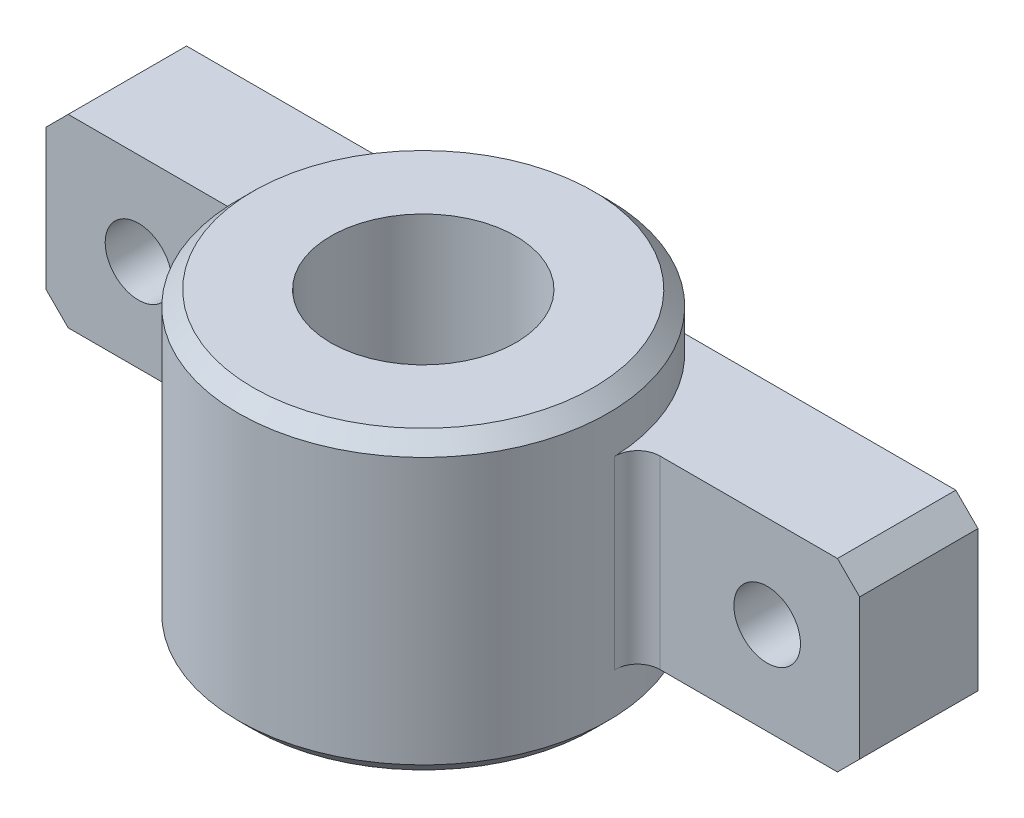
ISO-10303-21;
HEADER;
FILE_DESCRIPTION(('STEP AP214'),'2;1');
FILE_NAME('part.step','',(''),(''),'','','');
FILE_SCHEMA(('AUTOMOTIVE_DESIGN { 1 0 10303 214 1 1 1 1 }'));
ENDSEC;
DATA;
#1=APPLICATION_CONTEXT('core data for automotive mechanical design processes');
#2=APPLICATION_PROTOCOL_DEFINITION('international standard','automotive_design',2000,#1);
#3=PRODUCT_CONTEXT('',#1,'mechanical');
#4=PRODUCT('Part','Part','',(#3));
#5=PRODUCT_RELATED_PRODUCT_CATEGORY('part','',(#4));
#6=PRODUCT_DEFINITION_FORMATION('','',#4);
#7=PRODUCT_DEFINITION_CONTEXT('part definition',#1,'design');
#8=PRODUCT_DEFINITION('design','',#6,#7);
#9=PRODUCT_DEFINITION_SHAPE('','',#8);
#10=(LENGTH_UNIT() NAMED_UNIT(*) SI_UNIT(.MILLI.,.METRE.));
#11=(NAMED_UNIT(*) PLANE_ANGLE_UNIT() SI_UNIT($,.RADIAN.));
#12=(NAMED_UNIT(*) SI_UNIT($,.STERADIAN.) SOLID_ANGLE_UNIT());
#13=UNCERTAINTY_MEASURE_WITH_UNIT(LENGTH_MEASURE(1.E-05),#10,'distance_accuracy_value','');
#14=(GEOMETRIC_REPRESENTATION_CONTEXT(3) GLOBAL_UNCERTAINTY_ASSIGNED_CONTEXT((#13)) GLOBAL_UNIT_ASSIGNED_CONTEXT((#10,
#11,#12)) REPRESENTATION_CONTEXT('',''));
#15=CARTESIAN_POINT('',(0.,0.,0.));
#16=DIRECTION('',(0.,0.,1.));
#17=DIRECTION('',(1.,0.,0.));
#18=AXIS2_PLACEMENT_3D('',#15,#16,#17);
#19=CARTESIAN_POINT('',(0.,20.,0.));
#20=DIRECTION('',(0.,1.,0.));
#21=DIRECTION('',(0.,0.,1.));
#22=AXIS2_PLACEMENT_3D('',#19,#20,#21);
#23=PLANE('',#22);
#24=CARTESIAN_POINT('',(0.,20.,0.));
#25=DIRECTION('',(0.,1.,0.));
#26=DIRECTION('',(0.,0.,1.));
#27=AXIS2_PLACEMENT_3D('',#24,#25,#26);
#28=CIRCLE('',#27,23.);
#29=CARTESIAN_POINT('',(0.,20.,23.));
#30=VERTEX_POINT('',#29);
#31=EDGE_CURVE('E295',#30,#30,#28,.T.);
#32=ORIENTED_EDGE('',*,*,#31,.T.);
#33=EDGE_LOOP('',(#32));
#34=FACE_BOUND('',#33,.T.);
#35=CARTESIAN_POINT('',(0.,20.,0.));
#36=DIRECTION('',(0.,1.,0.));
#37=DIRECTION('',(0.,0.,1.));
#38=AXIS2_PLACEMENT_3D('',#35,#36,#37);
#39=CIRCLE('',#38,12.5);
#40=CARTESIAN_POINT('',(0.,20.,12.5));
#41=VERTEX_POINT('',#40);
#42=EDGE_CURVE('E229',#41,#41,#39,.T.);
#43=ORIENTED_EDGE('',*,*,#42,.F.);
#44=EDGE_LOOP('',(#43));
#45=FACE_BOUND('',#44,.T.);
#46=ADVANCED_FACE('F41',(#34,#45),#23,.T.);
#47=CARTESIAN_POINT('',(0.,-20.,0.));
#48=DIRECTION('',(0.,1.,0.));
#49=DIRECTION('',(0.,0.,1.));
#50=AXIS2_PLACEMENT_3D('',#47,#48,#49);
#51=PLANE('',#50);
#52=CARTESIAN_POINT('',(0.,-20.,0.));
#53=DIRECTION('',(0.,1.,0.));
#54=DIRECTION('',(0.,0.,1.));
#55=AXIS2_PLACEMENT_3D('',#52,#53,#54);
#56=CIRCLE('',#55,13.5);
#57=CARTESIAN_POINT('',(0.,-20.,13.5));
#58=VERTEX_POINT('',#57);
#59=EDGE_CURVE('E50',#58,#58,#56,.T.);
#60=ORIENTED_EDGE('',*,*,#59,.T.);
#61=EDGE_LOOP('',(#60));
#62=FACE_BOUND('',#61,.T.);
#63=CARTESIAN_POINT('',(0.,-20.,0.));
#64=DIRECTION('',(0.,1.,0.));
#65=DIRECTION('',(0.,0.,1.));
#66=AXIS2_PLACEMENT_3D('',#63,#64,#65);
#67=CIRCLE('',#66,23.);
#68=CARTESIAN_POINT('',(0.,-20.,23.));
#69=VERTEX_POINT('',#68);
#70=EDGE_CURVE('E308',#69,#69,#67,.F.);
#71=ORIENTED_EDGE('',*,*,#70,.T.);
#72=EDGE_LOOP('',(#71));
#73=FACE_BOUND('',#72,.T.);
#74=ADVANCED_FACE('F315',(#62,#73),#51,.F.);
#75=CARTESIAN_POINT('',(0.,20.,0.));
#76=DIRECTION('',(0.,-1.,0.));
#77=DIRECTION('',(0.,0.,-1.));
#78=AXIS2_PLACEMENT_3D('',#75,#76,#77);
#79=CYLINDRICAL_SURFACE('',#78,25.);
#80=CARTESIAN_POINT('',(0.,18.,0.));
#81=DIRECTION('',(0.,1.,0.));
#82=DIRECTION('',(0.,0.,1.));
#83=AXIS2_PLACEMENT_3D('',#80,#81,#82);
#84=CIRCLE('',#83,25.);
#85=CARTESIAN_POINT('',(0.,18.,25.));
#86=VERTEX_POINT('',#85);
#87=EDGE_CURVE('E304',#86,#86,#84,.F.);
#88=ORIENTED_EDGE('',*,*,#87,.T.);
#89=EDGE_LOOP('',(#88));
#90=FACE_BOUND('',#89,.T.);
#91=CARTESIAN_POINT('',(0.,-18.,0.));
#92=DIRECTION('',(0.,1.,0.));
#93=DIRECTION('',(0.,0.,1.));
#94=AXIS2_PLACEMENT_3D('',#91,#92,#93);
#95=CIRCLE('',#94,25.);
#96=CARTESIAN_POINT('',(0.,-18.,25.));
#97=VERTEX_POINT('',#96);
#98=EDGE_CURVE('E300',#97,#97,#95,.T.);
#99=ORIENTED_EDGE('',*,*,#98,.T.);
#100=EDGE_LOOP('',(#99));
#101=FACE_BOUND('',#100,.T.);
#102=DIRECTION('',(0.,-1.,0.));
#103=VECTOR('',#102,1.);
#104=CARTESIAN_POINT('',(24.9840510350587,20.,-0.892857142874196));
#105=LINE('',#104,#103);
#106=CARTESIAN_POINT('',(24.9840510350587,-12.5,-0.892857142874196));
#107=VERTEX_POINT('',#106);
#108=CARTESIAN_POINT('',(24.9840510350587,12.5,-0.892857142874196));
#109=VERTEX_POINT('',#108);
#110=EDGE_CURVE('E288',#107,#109,#105,.F.);
#111=ORIENTED_EDGE('',*,*,#110,.T.);
#112=CARTESIAN_POINT('',(0.,12.5,0.));
#113=DIRECTION('',(0.,1.,0.));
#114=DIRECTION('',(0.,0.,1.));
#115=AXIS2_PLACEMENT_3D('',#112,#113,#114);
#116=CIRCLE('',#115,25.);
#117=CARTESIAN_POINT('',(15.,12.5,-20.));
#118=VERTEX_POINT('',#117);
#119=EDGE_CURVE('E155',#109,#118,#116,.T.);
#120=ORIENTED_EDGE('',*,*,#119,.T.);
#121=DIRECTION('',(0.,-1.,0.));
#122=VECTOR('',#121,1.);
#123=CARTESIAN_POINT('',(15.,12.5,-20.));
#124=LINE('',#123,#122);
#125=CARTESIAN_POINT('',(15.,-12.5,-20.));
#126=VERTEX_POINT('',#125);
#127=EDGE_CURVE('E148',#118,#126,#124,.T.);
#128=ORIENTED_EDGE('',*,*,#127,.T.);
#129=CARTESIAN_POINT('',(0.,-12.5,0.));
#130=DIRECTION('',(0.,1.,0.));
#131=DIRECTION('',(0.,0.,1.));
#132=AXIS2_PLACEMENT_3D('',#129,#130,#131);
#133=CIRCLE('',#132,25.);
#134=EDGE_CURVE('E153',#107,#126,#133,.T.);
#135=ORIENTED_EDGE('',*,*,#134,.F.);
#136=EDGE_LOOP('',(#111,#120,#128,#135));
#137=FACE_BOUND('',#136,.T.);
#138=CARTESIAN_POINT('',(0.,12.5,0.));
#139=DIRECTION('',(0.,1.,0.));
#140=DIRECTION('',(0.,0.,1.));
#141=AXIS2_PLACEMENT_3D('',#138,#139,#140);
#142=CIRCLE('',#141,25.);
#143=CARTESIAN_POINT('',(-15.,12.5,-20.));
#144=VERTEX_POINT('',#143);
#145=CARTESIAN_POINT('',(-24.9840510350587,12.5,-0.892857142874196));
#146=VERTEX_POINT('',#145);
#147=EDGE_CURVE('E235',#144,#146,#142,.T.);
#148=ORIENTED_EDGE('',*,*,#147,.T.);
#149=DIRECTION('',(0.,-1.,0.));
#150=VECTOR('',#149,1.);
#151=CARTESIAN_POINT('',(-24.9840510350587,20.,-0.892857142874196));
#152=LINE('',#151,#150);
#153=CARTESIAN_POINT('',(-24.9840510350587,-12.5,-0.892857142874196));
#154=VERTEX_POINT('',#153);
#155=EDGE_CURVE('E259',#146,#154,#152,.T.);
#156=ORIENTED_EDGE('',*,*,#155,.T.);
#157=CARTESIAN_POINT('',(0.,-12.5,0.));
#158=DIRECTION('',(0.,1.,0.));
#159=DIRECTION('',(0.,0.,1.));
#160=AXIS2_PLACEMENT_3D('',#157,#158,#159);
#161=CIRCLE('',#160,25.);
#162=CARTESIAN_POINT('',(-15.,-12.5,-20.));
#163=VERTEX_POINT('',#162);
#164=EDGE_CURVE('E232',#163,#154,#161,.T.);
#165=ORIENTED_EDGE('',*,*,#164,.F.);
#166=DIRECTION('',(0.,-1.,0.));
#167=VECTOR('',#166,1.);
#168=CARTESIAN_POINT('',(-15.,12.5,-20.));
#169=LINE('',#168,#167);
#170=EDGE_CURVE('E223',#144,#163,#169,.T.);
#171=ORIENTED_EDGE('',*,*,#170,.F.);
#172=EDGE_LOOP('',(#148,#156,#165,#171));
#173=FACE_BOUND('',#172,.T.);
#174=ADVANCED_FACE('F151',(#90,#101,#137,#173),#79,.T.);
#175=CARTESIAN_POINT('',(0.,20.,0.));
#176=DIRECTION('',(0.,-1.,0.));
#177=DIRECTION('',(0.,0.,-1.));
#178=AXIS2_PLACEMENT_3D('',#175,#176,#177);
#179=CYLINDRICAL_SURFACE('',#178,12.5);
#180=CARTESIAN_POINT('',(0.,-19.,0.));
#181=DIRECTION('',(0.,1.,0.));
#182=DIRECTION('',(0.,0.,1.));
#183=AXIS2_PLACEMENT_3D('',#180,#181,#182);
#184=CIRCLE('',#183,12.5);
#185=CARTESIAN_POINT('',(0.,-19.,12.5));
#186=VERTEX_POINT('',#185);
#187=EDGE_CURVE('E11',#186,#186,#184,.F.);
#188=ORIENTED_EDGE('',*,*,#187,.T.);
#189=EDGE_LOOP('',(#188));
#190=FACE_BOUND('',#189,.T.);
#191=ORIENTED_EDGE('',*,*,#42,.T.);
#192=EDGE_LOOP('',(#191));
#193=FACE_BOUND('',#192,.T.);
#194=ADVANCED_FACE('F336',(#190,#193),#179,.F.);
#195=CARTESIAN_POINT('',(-55.,12.5,-4.0000000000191));
#196=DIRECTION('',(0.,0.,-1.));
#197=DIRECTION('',(-1.,0.,0.));
#198=AXIS2_PLACEMENT_3D('',#195,#196,#197);
#199=PLANE('',#198);
#200=CARTESIAN_POINT('',(-42.5,0.,-4.0000000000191));
#201=DIRECTION('',(0.,0.,-1.));
#202=DIRECTION('',(-1.,0.,0.));
#203=AXIS2_PLACEMENT_3D('',#200,#201,#202);
#204=CIRCLE('',#203,4.5);
#205=CARTESIAN_POINT('',(-47.,0.,-4.0000000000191));
#206=VERTEX_POINT('',#205);
#207=EDGE_CURVE('E205',#206,#206,#204,.T.);
#208=ORIENTED_EDGE('',*,*,#207,.T.);
#209=EDGE_LOOP('',(#208));
#210=FACE_BOUND('',#209,.T.);
#211=DIRECTION('',(1.,0.,0.));
#212=VECTOR('',#211,1.);
#213=CARTESIAN_POINT('',(-55.,-12.5,-4.0000000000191));
#214=LINE('',#213,#212);
#215=CARTESIAN_POINT('',(-52.,-12.5,-4.0000000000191));
#216=VERTEX_POINT('',#215);
#217=CARTESIAN_POINT('',(-27.9821371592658,-12.5,-4.0000000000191));
#218=VERTEX_POINT('',#217);
#219=EDGE_CURVE('E214',#216,#218,#214,.T.);
#220=ORIENTED_EDGE('',*,*,#219,.T.);
#221=DIRECTION('',(0.,1.,0.));
#222=VECTOR('',#221,1.);
#223=CARTESIAN_POINT('',(-27.9821371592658,12.5,-4.0000000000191));
#224=LINE('',#223,#222);
#225=CARTESIAN_POINT('',(-27.9821371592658,12.5,-4.0000000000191));
#226=VERTEX_POINT('',#225);
#227=EDGE_CURVE('E255',#218,#226,#224,.T.);
#228=ORIENTED_EDGE('',*,*,#227,.T.);
#229=DIRECTION('',(1.,0.,0.));
#230=VECTOR('',#229,1.);
#231=CARTESIAN_POINT('',(-55.,12.5,-4.0000000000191));
#232=LINE('',#231,#230);
#233=CARTESIAN_POINT('',(-52.,12.5,-4.0000000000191));
#234=VERTEX_POINT('',#233);
#235=EDGE_CURVE('E206',#234,#226,#232,.T.);
#236=ORIENTED_EDGE('',*,*,#235,.F.);
#237=DIRECTION('',(-0.707106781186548,-0.707106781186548,0.));
#238=VECTOR('',#237,1.);
#239=CARTESIAN_POINT('',(-52.,12.5,-4.0000000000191));
#240=LINE('',#239,#238);
#241=CARTESIAN_POINT('',(-55.,9.49999999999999,-4.0000000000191));
#242=VERTEX_POINT('',#241);
#243=EDGE_CURVE('E242',#234,#242,#240,.T.);
#244=ORIENTED_EDGE('',*,*,#243,.T.);
#245=DIRECTION('',(0.,-1.,0.));
#246=VECTOR('',#245,1.);
#247=CARTESIAN_POINT('',(-55.,12.5,-4.0000000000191));
#248=LINE('',#247,#246);
#249=CARTESIAN_POINT('',(-55.,-9.50000000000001,-4.0000000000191));
#250=VERTEX_POINT('',#249);
#251=EDGE_CURVE('E226',#242,#250,#248,.T.);
#252=ORIENTED_EDGE('',*,*,#251,.T.);
#253=DIRECTION('',(-0.707106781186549,0.707106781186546,0.));
#254=VECTOR('',#253,1.);
#255=CARTESIAN_POINT('',(-55.,-9.50000000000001,-4.0000000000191));
#256=LINE('',#255,#254);
#257=EDGE_CURVE('E244',#250,#216,#256,.F.);
#258=ORIENTED_EDGE('',*,*,#257,.T.);
#259=EDGE_LOOP('',(#220,#228,#236,#244,#252,#258));
#260=FACE_BOUND('',#259,.T.);
#261=ADVANCED_FACE('F442',(#210,#260),#199,.F.);
#262=CARTESIAN_POINT('',(-55.,12.5,-20.));
#263=DIRECTION('',(1.,0.,0.));
#264=DIRECTION('',(0.,0.,-1.));
#265=AXIS2_PLACEMENT_3D('',#262,#263,#264);
#266=PLANE('',#265);
#267=DIRECTION('',(0.,-1.,0.));
#268=VECTOR('',#267,1.);
#269=CARTESIAN_POINT('',(-55.,12.5,-20.));
#270=LINE('',#269,#268);
#271=CARTESIAN_POINT('',(-55.,9.49999999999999,-20.));
#272=VERTEX_POINT('',#271);
#273=CARTESIAN_POINT('',(-55.,-9.50000000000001,-20.));
#274=VERTEX_POINT('',#273);
#275=EDGE_CURVE('E213',#272,#274,#270,.T.);
#276=ORIENTED_EDGE('',*,*,#275,.T.);
#277=DIRECTION('',(0.,0.,1.));
#278=VECTOR('',#277,1.);
#279=CARTESIAN_POINT('',(-55.,-9.50000000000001,-20.));
#280=LINE('',#279,#278);
#281=EDGE_CURVE('E239',#274,#250,#280,.T.);
#282=ORIENTED_EDGE('',*,*,#281,.T.);
#283=ORIENTED_EDGE('',*,*,#251,.F.);
#284=DIRECTION('',(0.,0.,-1.));
#285=VECTOR('',#284,1.);
#286=CARTESIAN_POINT('',(-55.,9.49999999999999,-20.));
#287=LINE('',#286,#285);
#288=EDGE_CURVE('E237',#242,#272,#287,.T.);
#289=ORIENTED_EDGE('',*,*,#288,.T.);
#290=EDGE_LOOP('',(#276,#282,#283,#289));
#291=FACE_BOUND('',#290,.T.);
#292=ADVANCED_FACE('F440',(#291),#266,.F.);
#293=CARTESIAN_POINT('',(-55.,12.5,-20.));
#294=DIRECTION('',(0.,0.,1.));
#295=DIRECTION('',(1.,0.,0.));
#296=AXIS2_PLACEMENT_3D('',#293,#294,#295);
#297=PLANE('',#296);
#298=CARTESIAN_POINT('',(-42.5,0.,-20.));
#299=DIRECTION('',(0.,0.,-1.));
#300=DIRECTION('',(-1.,0.,0.));
#301=AXIS2_PLACEMENT_3D('',#298,#299,#300);
#302=CIRCLE('',#301,8.525);
#303=CARTESIAN_POINT('',(-51.025,0.,-20.));
#304=VERTEX_POINT('',#303);
#305=EDGE_CURVE('E193',#304,#304,#302,.T.);
#306=ORIENTED_EDGE('',*,*,#305,.F.);
#307=EDGE_LOOP('',(#306));
#308=FACE_BOUND('',#307,.T.);
#309=DIRECTION('',(-1.,0.,0.));
#310=VECTOR('',#309,1.);
#311=CARTESIAN_POINT('',(-55.,-12.5,-20.));
#312=LINE('',#311,#310);
#313=CARTESIAN_POINT('',(-52.,-12.5,-20.));
#314=VERTEX_POINT('',#313);
#315=EDGE_CURVE('E210',#163,#314,#312,.T.);
#316=ORIENTED_EDGE('',*,*,#315,.T.);
#317=DIRECTION('',(0.707106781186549,-0.707106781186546,0.));
#318=VECTOR('',#317,1.);
#319=CARTESIAN_POINT('',(-55.,-9.50000000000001,-20.));
#320=LINE('',#319,#318);
#321=EDGE_CURVE('E250',#314,#274,#320,.F.);
#322=ORIENTED_EDGE('',*,*,#321,.T.);
#323=ORIENTED_EDGE('',*,*,#275,.F.);
#324=DIRECTION('',(0.707106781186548,0.707106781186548,0.));
#325=VECTOR('',#324,1.);
#326=CARTESIAN_POINT('',(-52.,12.5,-20.));
#327=LINE('',#326,#325);
#328=CARTESIAN_POINT('',(-52.,12.5,-20.));
#329=VERTEX_POINT('',#328);
#330=EDGE_CURVE('E248',#272,#329,#327,.T.);
#331=ORIENTED_EDGE('',*,*,#330,.T.);
#332=DIRECTION('',(-1.,0.,0.));
#333=VECTOR('',#332,1.);
#334=CARTESIAN_POINT('',(-55.,12.5,-20.));
#335=LINE('',#334,#333);
#336=EDGE_CURVE('E209',#144,#329,#335,.T.);
#337=ORIENTED_EDGE('',*,*,#336,.F.);
#338=ORIENTED_EDGE('',*,*,#170,.T.);
#339=EDGE_LOOP('',(#316,#322,#323,#331,#337,#338));
#340=FACE_BOUND('',#339,.T.);
#341=ADVANCED_FACE('F433',(#308,#340),#297,.F.);
#342=CARTESIAN_POINT('',(0.,12.5,0.));
#343=DIRECTION('',(0.,1.,0.));
#344=DIRECTION('',(0.,0.,1.));
#345=AXIS2_PLACEMENT_3D('',#342,#343,#344);
#346=PLANE('',#345);
#347=ORIENTED_EDGE('',*,*,#336,.T.);
#348=DIRECTION('',(0.,0.,1.));
#349=VECTOR('',#348,1.);
#350=CARTESIAN_POINT('',(-52.,12.5,-4.0000000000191));
#351=LINE('',#350,#349);
#352=EDGE_CURVE('E252',#329,#234,#351,.T.);
#353=ORIENTED_EDGE('',*,*,#352,.T.);
#354=ORIENTED_EDGE('',*,*,#235,.T.);
#355=CARTESIAN_POINT('',(-27.9821371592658,12.5,-1.0000000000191));
#356=DIRECTION('',(0.,1.,0.));
#357=DIRECTION('',(0.,0.,1.));
#358=AXIS2_PLACEMENT_3D('',#355,#356,#357);
#359=CIRCLE('',#358,3.);
#360=EDGE_CURVE('E263',#226,#146,#359,.F.);
#361=ORIENTED_EDGE('',*,*,#360,.T.);
#362=ORIENTED_EDGE('',*,*,#147,.F.);
#363=EDGE_LOOP('',(#347,#353,#354,#361,#362));
#364=FACE_BOUND('',#363,.T.);
#365=ADVANCED_FACE('F430',(#364),#346,.T.);
#366=CARTESIAN_POINT('',(0.,-12.5,0.));
#367=DIRECTION('',(0.,1.,0.));
#368=DIRECTION('',(0.,0.,1.));
#369=AXIS2_PLACEMENT_3D('',#366,#367,#368);
#370=PLANE('',#369);
#371=ORIENTED_EDGE('',*,*,#219,.F.);
#372=DIRECTION('',(0.,0.,-1.));
#373=VECTOR('',#372,1.);
#374=CARTESIAN_POINT('',(-52.,-12.5,0.));
#375=LINE('',#374,#373);
#376=EDGE_CURVE('E246',#216,#314,#375,.T.);
#377=ORIENTED_EDGE('',*,*,#376,.T.);
#378=ORIENTED_EDGE('',*,*,#315,.F.);
#379=ORIENTED_EDGE('',*,*,#164,.T.);
#380=CARTESIAN_POINT('',(-27.9821371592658,-12.5,-1.0000000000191));
#381=DIRECTION('',(0.,1.,0.));
#382=DIRECTION('',(0.,0.,1.));
#383=AXIS2_PLACEMENT_3D('',#380,#381,#382);
#384=CIRCLE('',#383,3.);
#385=EDGE_CURVE('E172',#154,#218,#384,.T.);
#386=ORIENTED_EDGE('',*,*,#385,.T.);
#387=EDGE_LOOP('',(#371,#377,#378,#379,#386));
#388=FACE_BOUND('',#387,.T.);
#389=ADVANCED_FACE('F346',(#388),#370,.F.);
#390=CARTESIAN_POINT('',(-55.,-9.50000000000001,-20.));
#391=DIRECTION('',(0.707106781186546,0.707106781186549,0.));
#392=DIRECTION('',(0.,0.,1.));
#393=AXIS2_PLACEMENT_3D('',#390,#391,#392);
#394=PLANE('',#393);
#395=ORIENTED_EDGE('',*,*,#321,.F.);
#396=ORIENTED_EDGE('',*,*,#376,.F.);
#397=ORIENTED_EDGE('',*,*,#257,.F.);
#398=ORIENTED_EDGE('',*,*,#281,.F.);
#399=EDGE_LOOP('',(#395,#396,#397,#398));
#400=FACE_BOUND('',#399,.T.);
#401=ADVANCED_FACE('F342',(#400),#394,.F.);
#402=CARTESIAN_POINT('',(-52.,12.5,0.));
#403=DIRECTION('',(-0.707106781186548,0.707106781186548,0.));
#404=DIRECTION('',(0.,0.,-1.));
#405=AXIS2_PLACEMENT_3D('',#402,#403,#404);
#406=PLANE('',#405);
#407=ORIENTED_EDGE('',*,*,#330,.F.);
#408=ORIENTED_EDGE('',*,*,#288,.F.);
#409=ORIENTED_EDGE('',*,*,#243,.F.);
#410=ORIENTED_EDGE('',*,*,#352,.F.);
#411=EDGE_LOOP('',(#407,#408,#409,#410));
#412=FACE_BOUND('',#411,.T.);
#413=ADVANCED_FACE('F345',(#412),#406,.T.);
#414=CARTESIAN_POINT('',(-27.9821371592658,20.,-1.0000000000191));
#415=DIRECTION('',(0.,-1.,0.));
#416=DIRECTION('',(0.,0.,-1.));
#417=AXIS2_PLACEMENT_3D('',#414,#415,#416);
#418=CYLINDRICAL_SURFACE('',#417,3.);
#419=ORIENTED_EDGE('',*,*,#385,.F.);
#420=ORIENTED_EDGE('',*,*,#155,.F.);
#421=ORIENTED_EDGE('',*,*,#360,.F.);
#422=ORIENTED_EDGE('',*,*,#227,.F.);
#423=EDGE_LOOP('',(#419,#420,#421,#422));
#424=FACE_BOUND('',#423,.T.);
#425=ADVANCED_FACE('F350',(#424),#418,.F.);
#426=CARTESIAN_POINT('',(-42.5,0.,-20.));
#427=DIRECTION('',(0.,0.,-1.));
#428=DIRECTION('',(-1.,0.,0.));
#429=AXIS2_PLACEMENT_3D('',#426,#427,#428);
#430=CYLINDRICAL_SURFACE('',#429,4.5);
#431=CARTESIAN_POINT('',(-42.5,0.,-11.4));
#432=DIRECTION('',(0.,0.,-1.));
#433=DIRECTION('',(-1.,0.,0.));
#434=AXIS2_PLACEMENT_3D('',#431,#432,#433);
#435=CIRCLE('',#434,4.5);
#436=CARTESIAN_POINT('',(-47.,0.,-11.4));
#437=VERTEX_POINT('',#436);
#438=EDGE_CURVE('E202',#437,#437,#435,.T.);
#439=ORIENTED_EDGE('',*,*,#438,.T.);
#440=EDGE_LOOP('',(#439));
#441=FACE_BOUND('',#440,.T.);
#442=ORIENTED_EDGE('',*,*,#207,.F.);
#443=EDGE_LOOP('',(#442));
#444=FACE_BOUND('',#443,.T.);
#445=ADVANCED_FACE('F354',(#441,#444),#430,.F.);
#446=CARTESIAN_POINT('',(-35.,0.,-11.4));
#447=DIRECTION('',(0.,0.,1.));
#448=DIRECTION('',(1.,0.,0.));
#449=AXIS2_PLACEMENT_3D('',#446,#447,#448);
#450=PLANE('',#449);
#451=ORIENTED_EDGE('',*,*,#438,.F.);
#452=EDGE_LOOP('',(#451));
#453=FACE_BOUND('',#452,.T.);
#454=CARTESIAN_POINT('',(-42.5,0.,-11.4));
#455=DIRECTION('',(0.,0.,-1.));
#456=DIRECTION('',(-1.,0.,0.));
#457=AXIS2_PLACEMENT_3D('',#454,#455,#456);
#458=CIRCLE('',#457,7.49999999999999);
#459=CARTESIAN_POINT('',(-50.,0.,-11.4));
#460=VERTEX_POINT('',#459);
#461=EDGE_CURVE('E199',#460,#460,#458,.T.);
#462=ORIENTED_EDGE('',*,*,#461,.T.);
#463=EDGE_LOOP('',(#462));
#464=FACE_BOUND('',#463,.T.);
#465=ADVANCED_FACE('F422',(#453,#464),#450,.F.);
#466=CARTESIAN_POINT('',(-42.5,0.,-20.));
#467=DIRECTION('',(0.,0.,-1.));
#468=DIRECTION('',(-1.,0.,0.));
#469=AXIS2_PLACEMENT_3D('',#466,#467,#468);
#470=CYLINDRICAL_SURFACE('',#469,7.5);
#471=ORIENTED_EDGE('',*,*,#461,.F.);
#472=EDGE_LOOP('',(#471));
#473=FACE_BOUND('',#472,.T.);
#474=CARTESIAN_POINT('',(-42.5,0.,-18.975));
#475=DIRECTION('',(0.,0.,-1.));
#476=DIRECTION('',(-1.,0.,0.));
#477=AXIS2_PLACEMENT_3D('',#474,#475,#476);
#478=CIRCLE('',#477,7.5);
#479=CARTESIAN_POINT('',(-50.,0.,-18.975));
#480=VERTEX_POINT('',#479);
#481=EDGE_CURVE('E196',#480,#480,#478,.T.);
#482=ORIENTED_EDGE('',*,*,#481,.T.);
#483=EDGE_LOOP('',(#482));
#484=FACE_BOUND('',#483,.T.);
#485=ADVANCED_FACE('F418',(#473,#484),#470,.F.);
#486=CARTESIAN_POINT('',(-42.5,0.,-20.));
#487=DIRECTION('',(0.,0.,-1.));
#488=DIRECTION('',(-1.,0.,0.));
#489=AXIS2_PLACEMENT_3D('',#486,#487,#488);
#490=CONICAL_SURFACE('',#489,8.525,0.785398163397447);
#491=ORIENTED_EDGE('',*,*,#481,.F.);
#492=EDGE_LOOP('',(#491));
#493=FACE_BOUND('',#492,.T.);
#494=ORIENTED_EDGE('',*,*,#305,.T.);
#495=EDGE_LOOP('',(#494));
#496=FACE_BOUND('',#495,.T.);
#497=ADVANCED_FACE('F408',(#493,#496),#490,.F.);
#498=CARTESIAN_POINT('',(55.,12.5,-4.0000000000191));
#499=DIRECTION('',(0.,0.,1.));
#500=DIRECTION('',(1.,0.,0.));
#501=AXIS2_PLACEMENT_3D('',#498,#499,#500);
#502=PLANE('',#501);
#503=CARTESIAN_POINT('',(42.5,0.,-4.0000000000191));
#504=DIRECTION('',(0.,0.,1.));
#505=DIRECTION('',(1.,0.,0.));
#506=AXIS2_PLACEMENT_3D('',#503,#504,#505);
#507=CIRCLE('',#506,4.5);
#508=CARTESIAN_POINT('',(47.,0.,-4.0000000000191));
#509=VERTEX_POINT('',#508);
#510=EDGE_CURVE('E179',#509,#509,#507,.T.);
#511=ORIENTED_EDGE('',*,*,#510,.F.);
#512=EDGE_LOOP('',(#511));
#513=FACE_BOUND('',#512,.T.);
#514=DIRECTION('',(-1.,0.,0.));
#515=VECTOR('',#514,1.);
#516=CARTESIAN_POINT('',(55.,12.5,-4.0000000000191));
#517=LINE('',#516,#515);
#518=CARTESIAN_POINT('',(52.,12.5,-4.0000000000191));
#519=VERTEX_POINT('',#518);
#520=CARTESIAN_POINT('',(27.9821371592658,12.5,-4.0000000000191));
#521=VERTEX_POINT('',#520);
#522=EDGE_CURVE('E187',#519,#521,#517,.T.);
#523=ORIENTED_EDGE('',*,*,#522,.T.);
#524=DIRECTION('',(0.,-1.,0.));
#525=VECTOR('',#524,1.);
#526=CARTESIAN_POINT('',(27.9821371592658,12.5,-4.0000000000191));
#527=LINE('',#526,#525);
#528=CARTESIAN_POINT('',(27.9821371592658,-12.5,-4.0000000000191));
#529=VERTEX_POINT('',#528);
#530=EDGE_CURVE('E66',#521,#529,#527,.T.);
#531=ORIENTED_EDGE('',*,*,#530,.T.);
#532=DIRECTION('',(-1.,0.,0.));
#533=VECTOR('',#532,1.);
#534=CARTESIAN_POINT('',(55.,-12.5,-4.0000000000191));
#535=LINE('',#534,#533);
#536=CARTESIAN_POINT('',(52.,-12.5,-4.0000000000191));
#537=VERTEX_POINT('',#536);
#538=EDGE_CURVE('E178',#537,#529,#535,.T.);
#539=ORIENTED_EDGE('',*,*,#538,.F.);
#540=DIRECTION('',(0.707106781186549,0.707106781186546,0.));
#541=VECTOR('',#540,1.);
#542=CARTESIAN_POINT('',(66.,1.49999999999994,-4.0000000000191));
#543=LINE('',#542,#541);
#544=CARTESIAN_POINT('',(55.,-9.50000000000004,-4.0000000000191));
#545=VERTEX_POINT('',#544);
#546=EDGE_CURVE('E276',#537,#545,#543,.T.);
#547=ORIENTED_EDGE('',*,*,#546,.T.);
#548=DIRECTION('',(0.,-1.,0.));
#549=VECTOR('',#548,1.);
#550=CARTESIAN_POINT('',(55.,12.5,-4.0000000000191));
#551=LINE('',#550,#549);
#552=CARTESIAN_POINT('',(55.,9.49999999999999,-4.0000000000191));
#553=VERTEX_POINT('',#552);
#554=EDGE_CURVE('E161',#553,#545,#551,.T.);
#555=ORIENTED_EDGE('',*,*,#554,.F.);
#556=DIRECTION('',(0.707106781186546,-0.707106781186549,0.));
#557=VECTOR('',#556,1.);
#558=CARTESIAN_POINT('',(53.5,11.,-4.0000000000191));
#559=LINE('',#558,#557);
#560=EDGE_CURVE('E274',#553,#519,#559,.F.);
#561=ORIENTED_EDGE('',*,*,#560,.T.);
#562=EDGE_LOOP('',(#523,#531,#539,#547,#555,#561));
#563=FACE_BOUND('',#562,.T.);
#564=ADVANCED_FACE('F404',(#513,#563),#502,.T.);
#565=CARTESIAN_POINT('',(55.,12.5,-20.));
#566=DIRECTION('',(1.,0.,0.));
#567=DIRECTION('',(0.,0.,-1.));
#568=AXIS2_PLACEMENT_3D('',#565,#566,#567);
#569=PLANE('',#568);
#570=ORIENTED_EDGE('',*,*,#554,.T.);
#571=DIRECTION('',(0.,0.,-1.));
#572=VECTOR('',#571,1.);
#573=CARTESIAN_POINT('',(55.,-9.50000000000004,-20.));
#574=LINE('',#573,#572);
#575=CARTESIAN_POINT('',(55.,-9.50000000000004,-20.));
#576=VERTEX_POINT('',#575);
#577=EDGE_CURVE('E281',#545,#576,#574,.T.);
#578=ORIENTED_EDGE('',*,*,#577,.T.);
#579=DIRECTION('',(0.,-1.,0.));
#580=VECTOR('',#579,1.);
#581=CARTESIAN_POINT('',(55.,12.5,-20.));
#582=LINE('',#581,#580);
#583=CARTESIAN_POINT('',(55.,9.49999999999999,-20.));
#584=VERTEX_POINT('',#583);
#585=EDGE_CURVE('E160',#584,#576,#582,.T.);
#586=ORIENTED_EDGE('',*,*,#585,.F.);
#587=DIRECTION('',(0.,0.,1.));
#588=VECTOR('',#587,1.);
#589=CARTESIAN_POINT('',(55.,9.49999999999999,-20.));
#590=LINE('',#589,#588);
#591=EDGE_CURVE('E278',#584,#553,#590,.T.);
#592=ORIENTED_EDGE('',*,*,#591,.T.);
#593=EDGE_LOOP('',(#570,#578,#586,#592));
#594=FACE_BOUND('',#593,.T.);
#595=ADVANCED_FACE('F407',(#594),#569,.T.);
#596=CARTESIAN_POINT('',(55.,12.5,-20.));
#597=DIRECTION('',(0.,0.,-1.));
#598=DIRECTION('',(-1.,0.,0.));
#599=AXIS2_PLACEMENT_3D('',#596,#597,#598);
#600=PLANE('',#599);
#601=CARTESIAN_POINT('',(42.5,0.,-20.));
#602=DIRECTION('',(0.,0.,-1.));
#603=DIRECTION('',(-1.,0.,0.));
#604=AXIS2_PLACEMENT_3D('',#601,#602,#603);
#605=CIRCLE('',#604,8.525);
#606=CARTESIAN_POINT('',(33.975,0.,-20.));
#607=VERTEX_POINT('',#606);
#608=EDGE_CURVE('E679',#607,#607,#605,.T.);
#609=ORIENTED_EDGE('',*,*,#608,.F.);
#610=EDGE_LOOP('',(#609));
#611=FACE_BOUND('',#610,.T.);
#612=ORIENTED_EDGE('',*,*,#585,.T.);
#613=DIRECTION('',(-0.707106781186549,-0.707106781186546,0.));
#614=VECTOR('',#613,1.);
#615=CARTESIAN_POINT('',(66.,1.49999999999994,-20.));
#616=LINE('',#615,#614);
#617=CARTESIAN_POINT('',(52.,-12.5,-20.));
#618=VERTEX_POINT('',#617);
#619=EDGE_CURVE('E177',#576,#618,#616,.T.);
#620=ORIENTED_EDGE('',*,*,#619,.T.);
#621=DIRECTION('',(1.,0.,0.));
#622=VECTOR('',#621,1.);
#623=CARTESIAN_POINT('',(55.,-12.5,-20.));
#624=LINE('',#623,#622);
#625=EDGE_CURVE('E167',#126,#618,#624,.T.);
#626=ORIENTED_EDGE('',*,*,#625,.F.);
#627=ORIENTED_EDGE('',*,*,#127,.F.);
#628=DIRECTION('',(1.,0.,0.));
#629=VECTOR('',#628,1.);
#630=CARTESIAN_POINT('',(55.,12.5,-20.));
#631=LINE('',#630,#629);
#632=CARTESIAN_POINT('',(52.,12.5,-20.));
#633=VERTEX_POINT('',#632);
#634=EDGE_CURVE('E181',#118,#633,#631,.T.);
#635=ORIENTED_EDGE('',*,*,#634,.T.);
#636=DIRECTION('',(-0.707106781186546,0.707106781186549,0.));
#637=VECTOR('',#636,1.);
#638=CARTESIAN_POINT('',(53.5,11.,-20.));
#639=LINE('',#638,#637);
#640=EDGE_CURVE('E283',#633,#584,#639,.F.);
#641=ORIENTED_EDGE('',*,*,#640,.T.);
#642=EDGE_LOOP('',(#612,#620,#626,#627,#635,#641));
#643=FACE_BOUND('',#642,.T.);
#644=ADVANCED_FACE('F175',(#611,#643),#600,.T.);
#645=CARTESIAN_POINT('',(0.,12.5,0.));
#646=DIRECTION('',(0.,1.,0.));
#647=DIRECTION('',(0.,0.,1.));
#648=AXIS2_PLACEMENT_3D('',#645,#646,#647);
#649=PLANE('',#648);
#650=ORIENTED_EDGE('',*,*,#522,.F.);
#651=DIRECTION('',(0.,0.,-1.));
#652=VECTOR('',#651,1.);
#653=CARTESIAN_POINT('',(52.,12.5,0.));
#654=LINE('',#653,#652);
#655=EDGE_CURVE('E286',#519,#633,#654,.T.);
#656=ORIENTED_EDGE('',*,*,#655,.T.);
#657=ORIENTED_EDGE('',*,*,#634,.F.);
#658=ORIENTED_EDGE('',*,*,#119,.F.);
#659=CARTESIAN_POINT('',(27.9821371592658,12.5,-1.0000000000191));
#660=DIRECTION('',(0.,1.,0.));
#661=DIRECTION('',(0.,0.,1.));
#662=AXIS2_PLACEMENT_3D('',#659,#660,#661);
#663=CIRCLE('',#662,3.);
#664=EDGE_CURVE('E59',#109,#521,#663,.F.);
#665=ORIENTED_EDGE('',*,*,#664,.T.);
#666=EDGE_LOOP('',(#650,#656,#657,#658,#665));
#667=FACE_BOUND('',#666,.T.);
#668=ADVANCED_FACE('F399',(#667),#649,.T.);
#669=CARTESIAN_POINT('',(0.,-12.5,0.));
#670=DIRECTION('',(0.,1.,0.));
#671=DIRECTION('',(0.,0.,1.));
#672=AXIS2_PLACEMENT_3D('',#669,#670,#671);
#673=PLANE('',#672);
#674=ORIENTED_EDGE('',*,*,#625,.T.);
#675=DIRECTION('',(0.,0.,1.));
#676=VECTOR('',#675,1.);
#677=CARTESIAN_POINT('',(52.,-12.5,-4.0000000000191));
#678=LINE('',#677,#676);
#679=EDGE_CURVE('E272',#618,#537,#678,.T.);
#680=ORIENTED_EDGE('',*,*,#679,.T.);
#681=ORIENTED_EDGE('',*,*,#538,.T.);
#682=CARTESIAN_POINT('',(27.9821371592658,-12.5,-1.0000000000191));
#683=DIRECTION('',(0.,1.,0.));
#684=DIRECTION('',(0.,0.,1.));
#685=AXIS2_PLACEMENT_3D('',#682,#683,#684);
#686=CIRCLE('',#685,3.);
#687=EDGE_CURVE('E170',#529,#107,#686,.T.);
#688=ORIENTED_EDGE('',*,*,#687,.T.);
#689=ORIENTED_EDGE('',*,*,#134,.T.);
#690=EDGE_LOOP('',(#674,#680,#681,#688,#689));
#691=FACE_BOUND('',#690,.T.);
#692=ADVANCED_FACE('F165',(#691),#673,.F.);
#693=CARTESIAN_POINT('',(52.,-12.5,0.));
#694=DIRECTION('',(0.707106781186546,-0.707106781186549,0.));
#695=DIRECTION('',(0.,0.,-1.));
#696=AXIS2_PLACEMENT_3D('',#693,#694,#695);
#697=PLANE('',#696);
#698=ORIENTED_EDGE('',*,*,#619,.F.);
#699=ORIENTED_EDGE('',*,*,#577,.F.);
#700=ORIENTED_EDGE('',*,*,#546,.F.);
#701=ORIENTED_EDGE('',*,*,#679,.F.);
#702=EDGE_LOOP('',(#698,#699,#700,#701));
#703=FACE_BOUND('',#702,.T.);
#704=ADVANCED_FACE('F356',(#703),#697,.T.);
#705=CARTESIAN_POINT('',(55.,9.49999999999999,-20.));
#706=DIRECTION('',(-0.707106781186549,-0.707106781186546,0.));
#707=DIRECTION('',(0.,0.,1.));
#708=AXIS2_PLACEMENT_3D('',#705,#706,#707);
#709=PLANE('',#708);
#710=ORIENTED_EDGE('',*,*,#640,.F.);
#711=ORIENTED_EDGE('',*,*,#655,.F.);
#712=ORIENTED_EDGE('',*,*,#560,.F.);
#713=ORIENTED_EDGE('',*,*,#591,.F.);
#714=EDGE_LOOP('',(#710,#711,#712,#713));
#715=FACE_BOUND('',#714,.T.);
#716=ADVANCED_FACE('F359',(#715),#709,.F.);
#717=CARTESIAN_POINT('',(27.9821371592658,20.,-1.0000000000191));
#718=DIRECTION('',(0.,-1.,0.));
#719=DIRECTION('',(0.,0.,-1.));
#720=AXIS2_PLACEMENT_3D('',#717,#718,#719);
#721=CYLINDRICAL_SURFACE('',#720,3.);
#722=ORIENTED_EDGE('',*,*,#687,.F.);
#723=ORIENTED_EDGE('',*,*,#530,.F.);
#724=ORIENTED_EDGE('',*,*,#664,.F.);
#725=ORIENTED_EDGE('',*,*,#110,.F.);
#726=EDGE_LOOP('',(#722,#723,#724,#725));
#727=FACE_BOUND('',#726,.T.);
#728=ADVANCED_FACE('F363',(#727),#721,.F.);
#729=CARTESIAN_POINT('',(42.5,0.,-20.));
#730=DIRECTION('',(0.,0.,-1.));
#731=DIRECTION('',(-1.,0.,0.));
#732=AXIS2_PLACEMENT_3D('',#729,#730,#731);
#733=CYLINDRICAL_SURFACE('',#732,4.5);
#734=ORIENTED_EDGE('',*,*,#510,.T.);
#735=EDGE_LOOP('',(#734));
#736=FACE_BOUND('',#735,.T.);
#737=CARTESIAN_POINT('',(42.5,0.,-11.4));
#738=DIRECTION('',(0.,0.,-1.));
#739=DIRECTION('',(-1.,0.,0.));
#740=AXIS2_PLACEMENT_3D('',#737,#738,#739);
#741=CIRCLE('',#740,4.5);
#742=CARTESIAN_POINT('',(38.,0.,-11.4));
#743=VERTEX_POINT('',#742);
#744=EDGE_CURVE('E184',#743,#743,#741,.T.);
#745=ORIENTED_EDGE('',*,*,#744,.T.);
#746=EDGE_LOOP('',(#745));
#747=FACE_BOUND('',#746,.T.);
#748=ADVANCED_FACE('F367',(#736,#747),#733,.F.);
#749=CARTESIAN_POINT('',(50.,0.,-11.4));
#750=DIRECTION('',(0.,0.,1.));
#751=DIRECTION('',(1.,0.,0.));
#752=AXIS2_PLACEMENT_3D('',#749,#750,#751);
#753=PLANE('',#752);
#754=ORIENTED_EDGE('',*,*,#744,.F.);
#755=EDGE_LOOP('',(#754));
#756=FACE_BOUND('',#755,.T.);
#757=CARTESIAN_POINT('',(42.5,0.,-11.4));
#758=DIRECTION('',(0.,0.,-1.));
#759=DIRECTION('',(-1.,0.,0.));
#760=AXIS2_PLACEMENT_3D('',#757,#758,#759);
#761=CIRCLE('',#760,7.49999999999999);
#762=CARTESIAN_POINT('',(35.,0.,-11.4));
#763=VERTEX_POINT('',#762);
#764=EDGE_CURVE('E673',#763,#763,#761,.T.);
#765=ORIENTED_EDGE('',*,*,#764,.T.);
#766=EDGE_LOOP('',(#765));
#767=FACE_BOUND('',#766,.T.);
#768=ADVANCED_FACE('F387',(#756,#767),#753,.F.);
#769=CARTESIAN_POINT('',(42.5,0.,-20.));
#770=DIRECTION('',(0.,0.,-1.));
#771=DIRECTION('',(-1.,0.,0.));
#772=AXIS2_PLACEMENT_3D('',#769,#770,#771);
#773=CYLINDRICAL_SURFACE('',#772,7.5);
#774=ORIENTED_EDGE('',*,*,#764,.F.);
#775=EDGE_LOOP('',(#774));
#776=FACE_BOUND('',#775,.T.);
#777=CARTESIAN_POINT('',(42.5,0.,-18.975));
#778=DIRECTION('',(0.,0.,-1.));
#779=DIRECTION('',(-1.,0.,0.));
#780=AXIS2_PLACEMENT_3D('',#777,#778,#779);
#781=CIRCLE('',#780,7.5);
#782=CARTESIAN_POINT('',(35.,0.,-18.975));
#783=VERTEX_POINT('',#782);
#784=EDGE_CURVE('E676',#783,#783,#781,.T.);
#785=ORIENTED_EDGE('',*,*,#784,.T.);
#786=EDGE_LOOP('',(#785));
#787=FACE_BOUND('',#786,.T.);
#788=ADVANCED_FACE('F375',(#776,#787),#773,.F.);
#789=CARTESIAN_POINT('',(42.5,0.,-20.));
#790=DIRECTION('',(0.,0.,-1.));
#791=DIRECTION('',(-1.,0.,0.));
#792=AXIS2_PLACEMENT_3D('',#789,#790,#791);
#793=CONICAL_SURFACE('',#792,8.525,0.785398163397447);
#794=ORIENTED_EDGE('',*,*,#784,.F.);
#795=EDGE_LOOP('',(#794));
#796=FACE_BOUND('',#795,.T.);
#797=ORIENTED_EDGE('',*,*,#608,.T.);
#798=EDGE_LOOP('',(#797));
#799=FACE_BOUND('',#798,.T.);
#800=ADVANCED_FACE('F370',(#796,#799),#793,.F.);
#801=CARTESIAN_POINT('',(0.,20.,0.));
#802=DIRECTION('',(0.,-1.,0.));
#803=DIRECTION('',(0.,0.,-1.));
#804=AXIS2_PLACEMENT_3D('',#801,#802,#803);
#805=CONICAL_SURFACE('',#804,23.,0.785398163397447);
#806=ORIENTED_EDGE('',*,*,#87,.F.);
#807=EDGE_LOOP('',(#806));
#808=FACE_BOUND('',#807,.T.);
#809=ORIENTED_EDGE('',*,*,#31,.F.);
#810=EDGE_LOOP('',(#809));
#811=FACE_BOUND('',#810,.T.);
#812=ADVANCED_FACE('F324',(#808,#811),#805,.T.);
#813=CARTESIAN_POINT('',(0.,-18.,0.));
#814=DIRECTION('',(0.,1.,0.));
#815=DIRECTION('',(0.,0.,1.));
#816=AXIS2_PLACEMENT_3D('',#813,#814,#815);
#817=CONICAL_SURFACE('',#816,25.,0.785398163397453);
#818=ORIENTED_EDGE('',*,*,#70,.F.);
#819=EDGE_LOOP('',(#818));
#820=FACE_BOUND('',#819,.T.);
#821=ORIENTED_EDGE('',*,*,#98,.F.);
#822=EDGE_LOOP('',(#821));
#823=FACE_BOUND('',#822,.T.);
#824=ADVANCED_FACE('F319',(#820,#823),#817,.T.);
#825=CARTESIAN_POINT('',(0.,-20.,0.));
#826=DIRECTION('',(0.,-1.,0.));
#827=DIRECTION('',(0.,0.,-1.));
#828=AXIS2_PLACEMENT_3D('',#825,#826,#827);
#829=CONICAL_SURFACE('',#828,13.5,0.785398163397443);
#830=ORIENTED_EDGE('',*,*,#187,.F.);
#831=EDGE_LOOP('',(#830));
#832=FACE_BOUND('',#831,.T.);
#833=ORIENTED_EDGE('',*,*,#59,.F.);
#834=EDGE_LOOP('',(#833));
#835=FACE_BOUND('',#834,.T.);
#836=ADVANCED_FACE('F43',(#832,#835),#829,.F.);
#837=CLOSED_SHELL('',(#46,#74,#174,#194,#261,#292,#341,#365,#389,#401,#413,#425,#445,#465,#485,
#497,#564,#595,#644,#668,#692,#704,#716,#728,#748,#768,#788,#800,#812,#824,#836));
#838=MANIFOLD_SOLID_BREP('B2',#837);
#839=ADVANCED_BREP_SHAPE_REPRESENTATION('',(#18,#838),#14);
#840=SHAPE_DEFINITION_REPRESENTATION(#9,#839);
ENDSEC;
END-ISO-10303-21;
